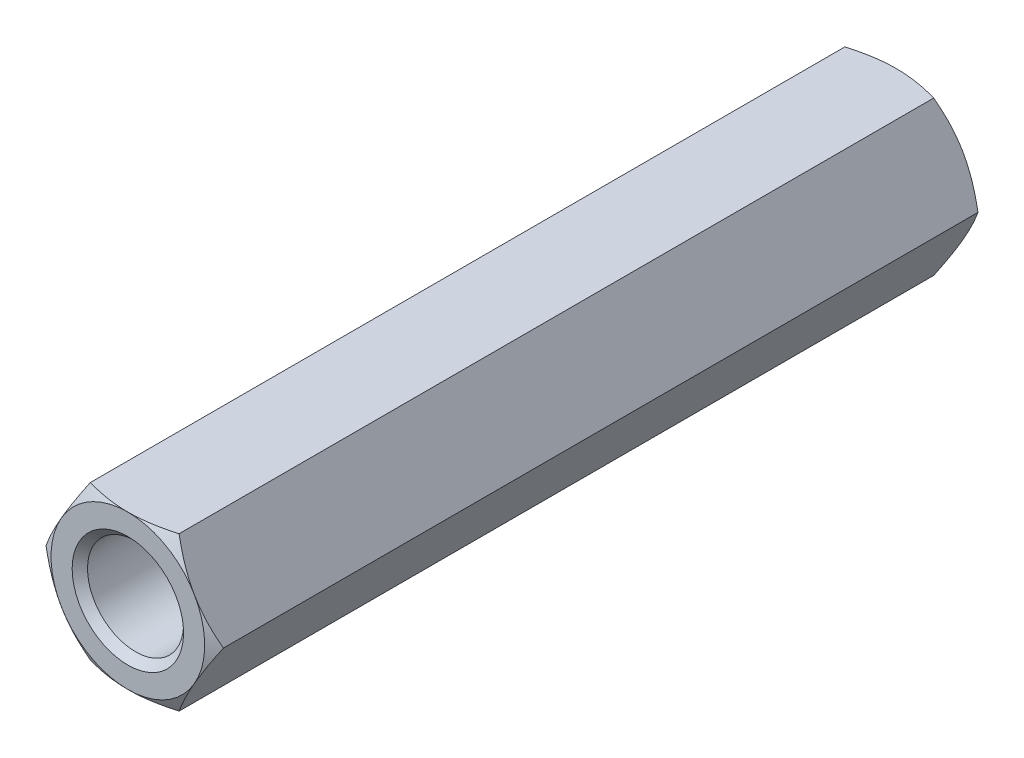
from build123d import *

# Parameters (mm, degrees)
BOSS_EXTRUDE1_DEPTH      = 20
SKETCH2_OUTSIDE_W        = 91.832
SKETCH2_OUTSIDE_H        = 90.594
SKETCH2_OUTSIDE_R        = 4
CUT_EXTRUDE1_DEPTH       = 21.912516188
CUT_EXTRUDE1_DRAFT       = -60
SKETCH3_R                = 2.5
SKETCH3_R_2              = 2.1
CUT_EXTRUDE2_DEPTH       = 10
SKETCH3_2_R              = 2.1
CUT_EXTRUDE3_DEPTH       = 11.2
CHAMFER1_SIZE            = 0.4
MIRROR1_COPY_1_SKETCH_W  = 91.832
MIRROR1_COPY_1_SKETCH_H  = 90.594
MIRROR1_COPY_1_SKETCH_R  = 4
MIRROR1_COPY_1_DEPTH     = 21.912516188
MIRROR1_COPY_1_DRAFT     = -60
CHAMFER1_OF_MIRROR1_SIZE = 0.4


with BuildPart() as part:
    # Sketch1 → Boss-Extrude1 (new body)
    with BuildSketch(Plane.XY):
        Polygon((2.309401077, 4), (-2.309401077, 4), (-4.618802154, 0), (-2.309401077, -4), (2.309401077, -4), (4.618802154, 0), align=None)
    boss_extrude1 = extrude(amount=-BOSS_EXTRUDE1_DEPTH)


with BuildPart() as cut_extrude1_tool:
    # Sketch2 outside → Cut-Extrude1 (with draft: the straight prism first)
    with BuildSketch(Plane(origin=(0, 0, -20), x_dir=(-1, 0, 0), z_dir=(0, 0, -1))):
        Rectangle(SKETCH2_OUTSIDE_W, SKETCH2_OUTSIDE_H)
        Circle(SKETCH2_OUTSIDE_R, mode=Mode.SUBTRACT)
    extrude(amount=-CUT_EXTRUDE1_DEPTH)
    # Cut-Extrude1: the draft: its side faces are tilted about the plane it starts from
    cut_extrude1_sides = [cut_extrude1_tool.faces().sort_by_distance(p)[0] for p in [
        (0, -45.297, -9.043741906),
        (-45.916, 0, -9.043741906),
        (0, 45.297, -9.043741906),
        (45.916, 0, -9.043741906),
        (4, 0, -9.043741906),
    ]]
    draft(cut_extrude1_sides, Plane(origin=(0, 0, -20), x_dir=(-1, 0, 0), z_dir=(0, 0, -1)), CUT_EXTRUDE1_DRAFT)


with BuildPart() as part_1:
    add(part.part)

    # Cut-Extrude1: cut by cut_extrude1_tool
    add(cut_extrude1_tool.part, mode=Mode.SUBTRACT)

    # Sketch3 → Cut-Extrude2 (cut)
    with BuildSketch(Plane(origin=(0, 0, -20), x_dir=(-1, 0, 0), z_dir=(0, 0, -1))):
        Circle(SKETCH3_R)
        Circle(SKETCH3_R_2, mode=Mode.SUBTRACT)
    cut_extrude2 = extrude(amount=-CUT_EXTRUDE2_DEPTH, mode=Mode.SUBTRACT)

    # Sketch3_2 → Cut-Extrude3 (cut)
    with BuildSketch(Plane(origin=(0, 0, -20), x_dir=(-1, 0, 0), z_dir=(0, 0, -1))):
        Circle(SKETCH3_2_R)
    cut_extrude3 = extrude(amount=-CUT_EXTRUDE3_DEPTH, mode=Mode.SUBTRACT)

    # Cut-Extrude4 cone 1 section (on through the dimple's axis) → Cut-Extrude4 (revolve, cut)
    with BuildSketch(Plane(origin=(0, 0, -8.8), x_dir=(0, 1, 0), z_dir=(1, 0, 0))):
        Polygon((0, 0), (2.1, 0), (0, 1.212435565), align=None)
    revolve(axis=Axis((0, 0, -8.8), (0, 0, 1)), mode=Mode.SUBTRACT)

    # Chamfer1
    chamfer1_edges = [part_1.edges().sort_by_distance(p)[0] for p in [
        (2.5, 0, -20),
    ]]
    chamfer(chamfer1_edges, length=CHAMFER1_SIZE)

    # Mirror1: Boss-Extrude1, Cut-Extrude2, Cut-Extrude3 across plane
    add(boss_extrude1.mirror(Plane.XY))
    add(cut_extrude2.mirror(Plane.XY), mode=Mode.SUBTRACT)
    add(cut_extrude3.mirror(Plane.XY), mode=Mode.SUBTRACT)


with BuildPart() as mirror1_copy_1_tool:
    # Mirror1 copy 1 sketch → Mirror1 copy 1 (with draft: the straight prism first)
    with BuildSketch(Plane(origin=(0, 0, 20), x_dir=(-1, 0, 0), z_dir=(0, 0, 1))):
        Rectangle(MIRROR1_COPY_1_SKETCH_W, MIRROR1_COPY_1_SKETCH_H)
        Circle(MIRROR1_COPY_1_SKETCH_R, mode=Mode.SUBTRACT)
    extrude(amount=-MIRROR1_COPY_1_DEPTH)
    # Mirror1 copy 1: the draft: its side faces are tilted about the plane it starts from
    mirror1_copy_1_sides = [mirror1_copy_1_tool.faces().sort_by_distance(p)[0] for p in [
        (0, -45.297, 9.043741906),
        (-45.916, 0, 9.043741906),
        (0, 45.297, 9.043741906),
        (45.916, 0, 9.043741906),
        (4, 0, 9.043741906),
    ]]
    draft(mirror1_copy_1_sides, Plane(origin=(0, 0, 20), x_dir=(-1, 0, 0), z_dir=(0, 0, 1)), MIRROR1_COPY_1_DRAFT)


with BuildPart() as part_2:
    add(part_1.part)

    # Mirror1 copy 1: cut by mirror1_copy_1_tool
    add(mirror1_copy_1_tool.part, mode=Mode.SUBTRACT)

    # Chamfer1 of Mirror1
    chamfer1_of_mirror1_edges = [part_2.edges().sort_by_distance(p)[0] for p in [
        (2.5, 0, 20),
    ]]
    chamfer(chamfer1_of_mirror1_edges, length=CHAMFER1_OF_MIRROR1_SIZE)


solid = part_2.part
